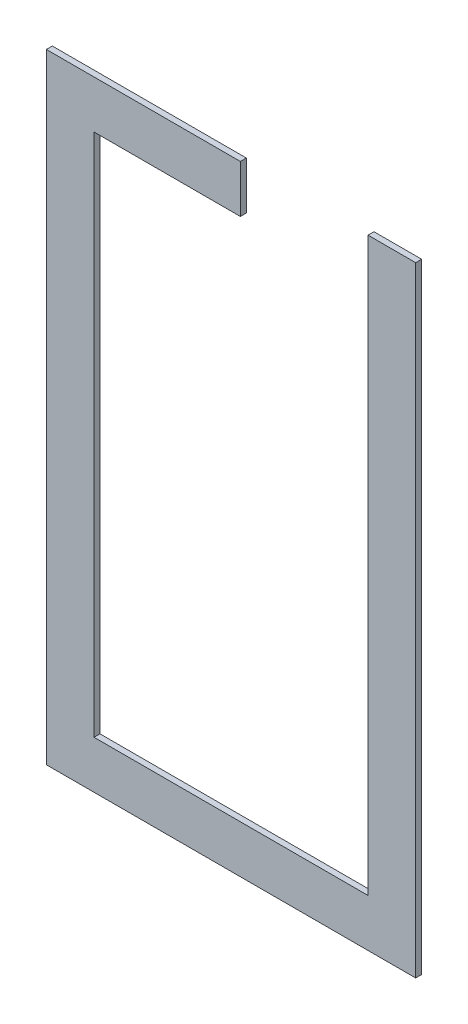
ISO-10303-21;
HEADER;
FILE_DESCRIPTION(('STEP AP214'),'2;1');
FILE_NAME('part.step','',(''),(''),'','','');
FILE_SCHEMA(('AUTOMOTIVE_DESIGN { 1 0 10303 214 1 1 1 1 }'));
ENDSEC;
DATA;
#1=APPLICATION_CONTEXT('core data for automotive mechanical design processes');
#2=APPLICATION_PROTOCOL_DEFINITION('international standard','automotive_design',2000,#1);
#3=PRODUCT_CONTEXT('',#1,'mechanical');
#4=PRODUCT('Part','Part','',(#3));
#5=PRODUCT_RELATED_PRODUCT_CATEGORY('part','',(#4));
#6=PRODUCT_DEFINITION_FORMATION('','',#4);
#7=PRODUCT_DEFINITION_CONTEXT('part definition',#1,'design');
#8=PRODUCT_DEFINITION('design','',#6,#7);
#9=PRODUCT_DEFINITION_SHAPE('','',#8);
#10=(LENGTH_UNIT() NAMED_UNIT(*) SI_UNIT(.MILLI.,.METRE.));
#11=(NAMED_UNIT(*) PLANE_ANGLE_UNIT() SI_UNIT($,.RADIAN.));
#12=(NAMED_UNIT(*) SI_UNIT($,.STERADIAN.) SOLID_ANGLE_UNIT());
#13=UNCERTAINTY_MEASURE_WITH_UNIT(LENGTH_MEASURE(1.E-05),#10,'distance_accuracy_value','');
#14=(GEOMETRIC_REPRESENTATION_CONTEXT(3) GLOBAL_UNCERTAINTY_ASSIGNED_CONTEXT((#13)) GLOBAL_UNIT_ASSIGNED_CONTEXT((#10,
#11,#12)) REPRESENTATION_CONTEXT('',''));
#15=CARTESIAN_POINT('',(0.,0.,0.));
#16=DIRECTION('',(0.,0.,1.));
#17=DIRECTION('',(1.,0.,0.));
#18=AXIS2_PLACEMENT_3D('',#15,#16,#17);
#19=CARTESIAN_POINT('',(0.,0.,-0.94));
#20=DIRECTION('',(0.,0.,-1.));
#21=DIRECTION('',(0.,-1.,0.));
#22=AXIS2_PLACEMENT_3D('',#19,#20,#21);
#23=PLANE('',#22);
#24=DIRECTION('',(0.,-1.,0.));
#25=VECTOR('',#24,1.);
#26=CARTESIAN_POINT('',(37.96999999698,51.13,-0.94));
#27=LINE('',#26,#25);
#28=CARTESIAN_POINT('',(37.96999999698,51.13,-0.94));
#29=VERTEX_POINT('',#28);
#30=CARTESIAN_POINT('',(37.96999999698,-52.87000000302,-0.94));
#31=VERTEX_POINT('',#30);
#32=EDGE_CURVE('E11',#29,#31,#27,.T.);
#33=ORIENTED_EDGE('',*,*,#32,.T.);
#34=DIRECTION('',(-1.,0.,0.));
#35=VECTOR('',#34,1.);
#36=CARTESIAN_POINT('',(37.96999999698,-52.87000000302,-0.94));
#37=LINE('',#36,#35);
#38=CARTESIAN_POINT('',(-24.03000000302,-52.87000000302,-0.94));
#39=VERTEX_POINT('',#38);
#40=EDGE_CURVE('E42',#31,#39,#37,.T.);
#41=ORIENTED_EDGE('',*,*,#40,.T.);
#42=DIRECTION('',(0.,1.,0.));
#43=VECTOR('',#42,1.);
#44=CARTESIAN_POINT('',(-24.03000000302,-52.87000000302,-0.94));
#45=LINE('',#44,#43);
#46=CARTESIAN_POINT('',(-24.03000000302,51.13,-0.94));
#47=VERTEX_POINT('',#46);
#48=EDGE_CURVE('E160',#39,#47,#45,.T.);
#49=ORIENTED_EDGE('',*,*,#48,.T.);
#50=DIRECTION('',(1.,0.,0.));
#51=VECTOR('',#50,1.);
#52=CARTESIAN_POINT('',(-24.03000000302,51.13,-0.94));
#53=LINE('',#52,#51);
#54=CARTESIAN_POINT('',(8.538636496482,51.13,-0.94));
#55=VERTEX_POINT('',#54);
#56=EDGE_CURVE('E189',#47,#55,#53,.T.);
#57=ORIENTED_EDGE('',*,*,#56,.T.);
#58=DIRECTION('',(0.,-1.,0.));
#59=VECTOR('',#58,1.);
#60=CARTESIAN_POINT('',(8.538636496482,51.13,-0.94));
#61=LINE('',#60,#59);
#62=CARTESIAN_POINT('',(8.538636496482,43.13,-0.94));
#63=VERTEX_POINT('',#62);
#64=EDGE_CURVE('E218',#55,#63,#61,.T.);
#65=ORIENTED_EDGE('',*,*,#64,.T.);
#66=DIRECTION('',(-1.,0.,0.));
#67=VECTOR('',#66,1.);
#68=CARTESIAN_POINT('',(8.538636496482,43.13,-0.94));
#69=LINE('',#68,#67);
#70=CARTESIAN_POINT('',(-16.03000000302,43.13,-0.94));
#71=VERTEX_POINT('',#70);
#72=EDGE_CURVE('E211',#63,#71,#69,.T.);
#73=ORIENTED_EDGE('',*,*,#72,.T.);
#74=DIRECTION('',(0.,-1.,0.));
#75=VECTOR('',#74,1.);
#76=CARTESIAN_POINT('',(-16.03000000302,43.13,-0.94));
#77=LINE('',#76,#75);
#78=CARTESIAN_POINT('',(-16.03000000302,-44.87000000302,-0.94));
#79=VERTEX_POINT('',#78);
#80=EDGE_CURVE('E204',#71,#79,#77,.T.);
#81=ORIENTED_EDGE('',*,*,#80,.T.);
#82=DIRECTION('',(1.,0.,0.));
#83=VECTOR('',#82,1.);
#84=CARTESIAN_POINT('',(-16.03000000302,-44.87000000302,-0.94));
#85=LINE('',#84,#83);
#86=CARTESIAN_POINT('',(29.96999999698,-44.87000000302,-0.94));
#87=VERTEX_POINT('',#86);
#88=EDGE_CURVE('E128',#79,#87,#85,.T.);
#89=ORIENTED_EDGE('',*,*,#88,.T.);
#90=DIRECTION('',(0.,1.,0.));
#91=VECTOR('',#90,1.);
#92=CARTESIAN_POINT('',(29.96999999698,-44.87000000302,-0.94));
#93=LINE('',#92,#91);
#94=CARTESIAN_POINT('',(29.96999999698,51.13,-0.94));
#95=VERTEX_POINT('',#94);
#96=EDGE_CURVE('E124',#87,#95,#93,.T.);
#97=ORIENTED_EDGE('',*,*,#96,.T.);
#98=DIRECTION('',(1.,0.,0.));
#99=VECTOR('',#98,1.);
#100=CARTESIAN_POINT('',(29.96999999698,51.13,-0.94));
#101=LINE('',#100,#99);
#102=EDGE_CURVE('E156',#95,#29,#101,.T.);
#103=ORIENTED_EDGE('',*,*,#102,.T.);
#104=EDGE_LOOP('',(#33,#41,#49,#57,#65,#73,#81,#89,#97,#103));
#105=FACE_BOUND('',#104,.T.);
#106=ADVANCED_FACE('F17',(#105),#23,.T.);
#107=CARTESIAN_POINT('',(37.96999999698,51.13,0.06));
#108=DIRECTION('',(1.,0.,0.));
#109=DIRECTION('',(0.,1.,0.));
#110=AXIS2_PLACEMENT_3D('',#107,#108,#109);
#111=PLANE('',#110);
#112=DIRECTION('',(0.,0.,-1.));
#113=VECTOR('',#112,1.);
#114=CARTESIAN_POINT('',(37.96999999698,-52.87000000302,0.06));
#115=LINE('',#114,#113);
#116=CARTESIAN_POINT('',(37.96999999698,-52.87000000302,0.06));
#117=VERTEX_POINT('',#116);
#118=EDGE_CURVE('E25',#117,#31,#115,.T.);
#119=ORIENTED_EDGE('',*,*,#118,.T.);
#120=ORIENTED_EDGE('',*,*,#32,.F.);
#121=DIRECTION('',(0.,0.,-1.));
#122=VECTOR('',#121,1.);
#123=CARTESIAN_POINT('',(37.96999999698,51.13,0.06));
#124=LINE('',#123,#122);
#125=CARTESIAN_POINT('',(37.96999999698,51.13,0.06));
#126=VERTEX_POINT('',#125);
#127=EDGE_CURVE('E158',#126,#29,#124,.T.);
#128=ORIENTED_EDGE('',*,*,#127,.F.);
#129=DIRECTION('',(0.,-1.,0.));
#130=VECTOR('',#129,1.);
#131=CARTESIAN_POINT('',(37.96999999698,51.13,0.06));
#132=LINE('',#131,#130);
#133=EDGE_CURVE('E186',#126,#117,#132,.T.);
#134=ORIENTED_EDGE('',*,*,#133,.T.);
#135=EDGE_LOOP('',(#119,#120,#128,#134));
#136=FACE_BOUND('',#135,.T.);
#137=ADVANCED_FACE('F234',(#136),#111,.T.);
#138=CARTESIAN_POINT('',(37.96999999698,-52.87000000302,0.06));
#139=DIRECTION('',(0.,-1.,0.));
#140=DIRECTION('',(0.,0.,-1.));
#141=AXIS2_PLACEMENT_3D('',#138,#139,#140);
#142=PLANE('',#141);
#143=DIRECTION('',(0.,0.,-1.));
#144=VECTOR('',#143,1.);
#145=CARTESIAN_POINT('',(-24.03000000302,-52.87000000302,0.06));
#146=LINE('',#145,#144);
#147=CARTESIAN_POINT('',(-24.03000000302,-52.87000000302,0.06));
#148=VERTEX_POINT('',#147);
#149=EDGE_CURVE('E163',#148,#39,#146,.T.);
#150=ORIENTED_EDGE('',*,*,#149,.T.);
#151=ORIENTED_EDGE('',*,*,#40,.F.);
#152=ORIENTED_EDGE('',*,*,#118,.F.);
#153=DIRECTION('',(-1.,0.,0.));
#154=VECTOR('',#153,1.);
#155=CARTESIAN_POINT('',(37.96999999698,-52.87000000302,0.06));
#156=LINE('',#155,#154);
#157=EDGE_CURVE('E179',#117,#148,#156,.T.);
#158=ORIENTED_EDGE('',*,*,#157,.T.);
#159=EDGE_LOOP('',(#150,#151,#152,#158));
#160=FACE_BOUND('',#159,.T.);
#161=ADVANCED_FACE('F237',(#160),#142,.T.);
#162=CARTESIAN_POINT('',(-24.03000000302,-52.87000000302,0.06));
#163=DIRECTION('',(-1.,0.,0.));
#164=DIRECTION('',(0.,0.,1.));
#165=AXIS2_PLACEMENT_3D('',#162,#163,#164);
#166=PLANE('',#165);
#167=DIRECTION('',(0.,0.,-1.));
#168=VECTOR('',#167,1.);
#169=CARTESIAN_POINT('',(-24.03000000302,51.13,0.06));
#170=LINE('',#169,#168);
#171=CARTESIAN_POINT('',(-24.03000000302,51.13,0.06));
#172=VERTEX_POINT('',#171);
#173=EDGE_CURVE('E164',#172,#47,#170,.T.);
#174=ORIENTED_EDGE('',*,*,#173,.T.);
#175=ORIENTED_EDGE('',*,*,#48,.F.);
#176=ORIENTED_EDGE('',*,*,#149,.F.);
#177=DIRECTION('',(0.,1.,0.));
#178=VECTOR('',#177,1.);
#179=CARTESIAN_POINT('',(-24.03000000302,-52.87000000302,0.06));
#180=LINE('',#179,#178);
#181=EDGE_CURVE('E175',#148,#172,#180,.T.);
#182=ORIENTED_EDGE('',*,*,#181,.T.);
#183=EDGE_LOOP('',(#174,#175,#176,#182));
#184=FACE_BOUND('',#183,.T.);
#185=ADVANCED_FACE('F241',(#184),#166,.T.);
#186=CARTESIAN_POINT('',(-24.03000000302,51.13,0.06));
#187=DIRECTION('',(0.,1.,0.));
#188=DIRECTION('',(1.,0.,0.));
#189=AXIS2_PLACEMENT_3D('',#186,#187,#188);
#190=PLANE('',#189);
#191=DIRECTION('',(0.,0.,-1.));
#192=VECTOR('',#191,1.);
#193=CARTESIAN_POINT('',(8.538636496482,51.13,0.06));
#194=LINE('',#193,#192);
#195=CARTESIAN_POINT('',(8.538636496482,51.13,0.06));
#196=VERTEX_POINT('',#195);
#197=EDGE_CURVE('E192',#196,#55,#194,.T.);
#198=ORIENTED_EDGE('',*,*,#197,.T.);
#199=ORIENTED_EDGE('',*,*,#56,.F.);
#200=ORIENTED_EDGE('',*,*,#173,.F.);
#201=DIRECTION('',(1.,0.,0.));
#202=VECTOR('',#201,1.);
#203=CARTESIAN_POINT('',(-24.03000000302,51.13,0.06));
#204=LINE('',#203,#202);
#205=EDGE_CURVE('E155',#172,#196,#204,.T.);
#206=ORIENTED_EDGE('',*,*,#205,.T.);
#207=EDGE_LOOP('',(#198,#199,#200,#206));
#208=FACE_BOUND('',#207,.T.);
#209=ADVANCED_FACE('F246',(#208),#190,.T.);
#210=CARTESIAN_POINT('',(8.538636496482,51.13,0.06));
#211=DIRECTION('',(1.,0.,0.));
#212=DIRECTION('',(0.,1.,0.));
#213=AXIS2_PLACEMENT_3D('',#210,#211,#212);
#214=PLANE('',#213);
#215=DIRECTION('',(0.,0.,-1.));
#216=VECTOR('',#215,1.);
#217=CARTESIAN_POINT('',(8.538636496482,43.13,0.06));
#218=LINE('',#217,#216);
#219=CARTESIAN_POINT('',(8.538636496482,43.13,0.06));
#220=VERTEX_POINT('',#219);
#221=EDGE_CURVE('E214',#220,#63,#218,.T.);
#222=ORIENTED_EDGE('',*,*,#221,.T.);
#223=ORIENTED_EDGE('',*,*,#64,.F.);
#224=ORIENTED_EDGE('',*,*,#197,.F.);
#225=DIRECTION('',(0.,-1.,0.));
#226=VECTOR('',#225,1.);
#227=CARTESIAN_POINT('',(8.538636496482,51.13,0.06));
#228=LINE('',#227,#226);
#229=EDGE_CURVE('E171',#196,#220,#228,.T.);
#230=ORIENTED_EDGE('',*,*,#229,.T.);
#231=EDGE_LOOP('',(#222,#223,#224,#230));
#232=FACE_BOUND('',#231,.T.);
#233=ADVANCED_FACE('F250',(#232),#214,.T.);
#234=CARTESIAN_POINT('',(8.538636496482,43.13,0.06));
#235=DIRECTION('',(0.,-1.,0.));
#236=DIRECTION('',(0.,0.,-1.));
#237=AXIS2_PLACEMENT_3D('',#234,#235,#236);
#238=PLANE('',#237);
#239=DIRECTION('',(0.,0.,-1.));
#240=VECTOR('',#239,1.);
#241=CARTESIAN_POINT('',(-16.03000000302,43.13,0.06));
#242=LINE('',#241,#240);
#243=CARTESIAN_POINT('',(-16.03000000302,43.13,0.06));
#244=VERTEX_POINT('',#243);
#245=EDGE_CURVE('E207',#244,#71,#242,.T.);
#246=ORIENTED_EDGE('',*,*,#245,.T.);
#247=ORIENTED_EDGE('',*,*,#72,.F.);
#248=ORIENTED_EDGE('',*,*,#221,.F.);
#249=DIRECTION('',(-1.,0.,0.));
#250=VECTOR('',#249,1.);
#251=CARTESIAN_POINT('',(8.538636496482,43.13,0.06));
#252=LINE('',#251,#250);
#253=EDGE_CURVE('E167',#220,#244,#252,.T.);
#254=ORIENTED_EDGE('',*,*,#253,.T.);
#255=EDGE_LOOP('',(#246,#247,#248,#254));
#256=FACE_BOUND('',#255,.T.);
#257=ADVANCED_FACE('F254',(#256),#238,.T.);
#258=CARTESIAN_POINT('',(-16.03000000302,43.13,0.06));
#259=DIRECTION('',(1.,0.,0.));
#260=DIRECTION('',(0.,1.,0.));
#261=AXIS2_PLACEMENT_3D('',#258,#259,#260);
#262=PLANE('',#261);
#263=DIRECTION('',(0.,0.,-1.));
#264=VECTOR('',#263,1.);
#265=CARTESIAN_POINT('',(-16.03000000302,-44.87000000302,0.06));
#266=LINE('',#265,#264);
#267=CARTESIAN_POINT('',(-16.03000000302,-44.87000000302,0.06));
#268=VERTEX_POINT('',#267);
#269=EDGE_CURVE('E134',#268,#79,#266,.T.);
#270=ORIENTED_EDGE('',*,*,#269,.T.);
#271=ORIENTED_EDGE('',*,*,#80,.F.);
#272=ORIENTED_EDGE('',*,*,#245,.F.);
#273=DIRECTION('',(0.,-1.,0.));
#274=VECTOR('',#273,1.);
#275=CARTESIAN_POINT('',(-16.03000000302,43.13,0.06));
#276=LINE('',#275,#274);
#277=EDGE_CURVE('E139',#244,#268,#276,.T.);
#278=ORIENTED_EDGE('',*,*,#277,.T.);
#279=EDGE_LOOP('',(#270,#271,#272,#278));
#280=FACE_BOUND('',#279,.T.);
#281=ADVANCED_FACE('F257',(#280),#262,.T.);
#282=CARTESIAN_POINT('',(-16.03000000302,-44.87000000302,0.06));
#283=DIRECTION('',(0.,1.,0.));
#284=DIRECTION('',(1.,0.,0.));
#285=AXIS2_PLACEMENT_3D('',#282,#283,#284);
#286=PLANE('',#285);
#287=DIRECTION('',(0.,0.,-1.));
#288=VECTOR('',#287,1.);
#289=CARTESIAN_POINT('',(29.96999999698,-44.87000000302,0.06));
#290=LINE('',#289,#288);
#291=CARTESIAN_POINT('',(29.96999999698,-44.87000000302,0.06));
#292=VERTEX_POINT('',#291);
#293=EDGE_CURVE('E118',#292,#87,#290,.T.);
#294=ORIENTED_EDGE('',*,*,#293,.T.);
#295=ORIENTED_EDGE('',*,*,#88,.F.);
#296=ORIENTED_EDGE('',*,*,#269,.F.);
#297=DIRECTION('',(1.,0.,0.));
#298=VECTOR('',#297,1.);
#299=CARTESIAN_POINT('',(-16.03000000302,-44.87000000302,0.06));
#300=LINE('',#299,#298);
#301=EDGE_CURVE('E131',#268,#292,#300,.T.);
#302=ORIENTED_EDGE('',*,*,#301,.T.);
#303=EDGE_LOOP('',(#294,#295,#296,#302));
#304=FACE_BOUND('',#303,.T.);
#305=ADVANCED_FACE('F132',(#304),#286,.T.);
#306=CARTESIAN_POINT('',(29.96999999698,-44.87000000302,0.06));
#307=DIRECTION('',(-1.,0.,0.));
#308=DIRECTION('',(0.,0.,1.));
#309=AXIS2_PLACEMENT_3D('',#306,#307,#308);
#310=PLANE('',#309);
#311=DIRECTION('',(0.,0.,-1.));
#312=VECTOR('',#311,1.);
#313=CARTESIAN_POINT('',(29.96999999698,51.13,0.06));
#314=LINE('',#313,#312);
#315=CARTESIAN_POINT('',(29.96999999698,51.13,0.06));
#316=VERTEX_POINT('',#315);
#317=EDGE_CURVE('E157',#316,#95,#314,.T.);
#318=ORIENTED_EDGE('',*,*,#317,.T.);
#319=ORIENTED_EDGE('',*,*,#96,.F.);
#320=ORIENTED_EDGE('',*,*,#293,.F.);
#321=DIRECTION('',(0.,1.,0.));
#322=VECTOR('',#321,1.);
#323=CARTESIAN_POINT('',(29.96999999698,-44.87000000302,0.06));
#324=LINE('',#323,#322);
#325=EDGE_CURVE('E123',#292,#316,#324,.T.);
#326=ORIENTED_EDGE('',*,*,#325,.T.);
#327=EDGE_LOOP('',(#318,#319,#320,#326));
#328=FACE_BOUND('',#327,.T.);
#329=ADVANCED_FACE('F121',(#328),#310,.T.);
#330=CARTESIAN_POINT('',(29.96999999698,51.13,0.06));
#331=DIRECTION('',(0.,1.,0.));
#332=DIRECTION('',(1.,0.,0.));
#333=AXIS2_PLACEMENT_3D('',#330,#331,#332);
#334=PLANE('',#333);
#335=ORIENTED_EDGE('',*,*,#127,.T.);
#336=ORIENTED_EDGE('',*,*,#102,.F.);
#337=ORIENTED_EDGE('',*,*,#317,.F.);
#338=DIRECTION('',(1.,0.,0.));
#339=VECTOR('',#338,1.);
#340=CARTESIAN_POINT('',(29.96999999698,51.13,0.06));
#341=LINE('',#340,#339);
#342=EDGE_CURVE('E145',#316,#126,#341,.T.);
#343=ORIENTED_EDGE('',*,*,#342,.T.);
#344=EDGE_LOOP('',(#335,#336,#337,#343));
#345=FACE_BOUND('',#344,.T.);
#346=ADVANCED_FACE('F415',(#345),#334,.T.);
#347=CARTESIAN_POINT('',(0.,0.,0.06));
#348=DIRECTION('',(0.,0.,-1.));
#349=DIRECTION('',(0.,-1.,0.));
#350=AXIS2_PLACEMENT_3D('',#347,#348,#349);
#351=PLANE('',#350);
#352=ORIENTED_EDGE('',*,*,#325,.F.);
#353=ORIENTED_EDGE('',*,*,#301,.F.);
#354=ORIENTED_EDGE('',*,*,#277,.F.);
#355=ORIENTED_EDGE('',*,*,#253,.F.);
#356=ORIENTED_EDGE('',*,*,#229,.F.);
#357=ORIENTED_EDGE('',*,*,#205,.F.);
#358=ORIENTED_EDGE('',*,*,#181,.F.);
#359=ORIENTED_EDGE('',*,*,#157,.F.);
#360=ORIENTED_EDGE('',*,*,#133,.F.);
#361=ORIENTED_EDGE('',*,*,#342,.F.);
#362=EDGE_LOOP('',(#352,#353,#354,#355,#356,#357,#358,#359,#360,#361));
#363=FACE_BOUND('',#362,.T.);
#364=ADVANCED_FACE('F142',(#363),#351,.F.);
#365=CLOSED_SHELL('',(#106,#137,#161,#185,#209,#233,#257,#281,#305,#329,#346,#364));
#366=MANIFOLD_SOLID_BREP('B1',#365);
#367=ADVANCED_BREP_SHAPE_REPRESENTATION('',(#18,#366),#14);
#368=SHAPE_DEFINITION_REPRESENTATION(#9,#367);
ENDSEC;
END-ISO-10303-21;
